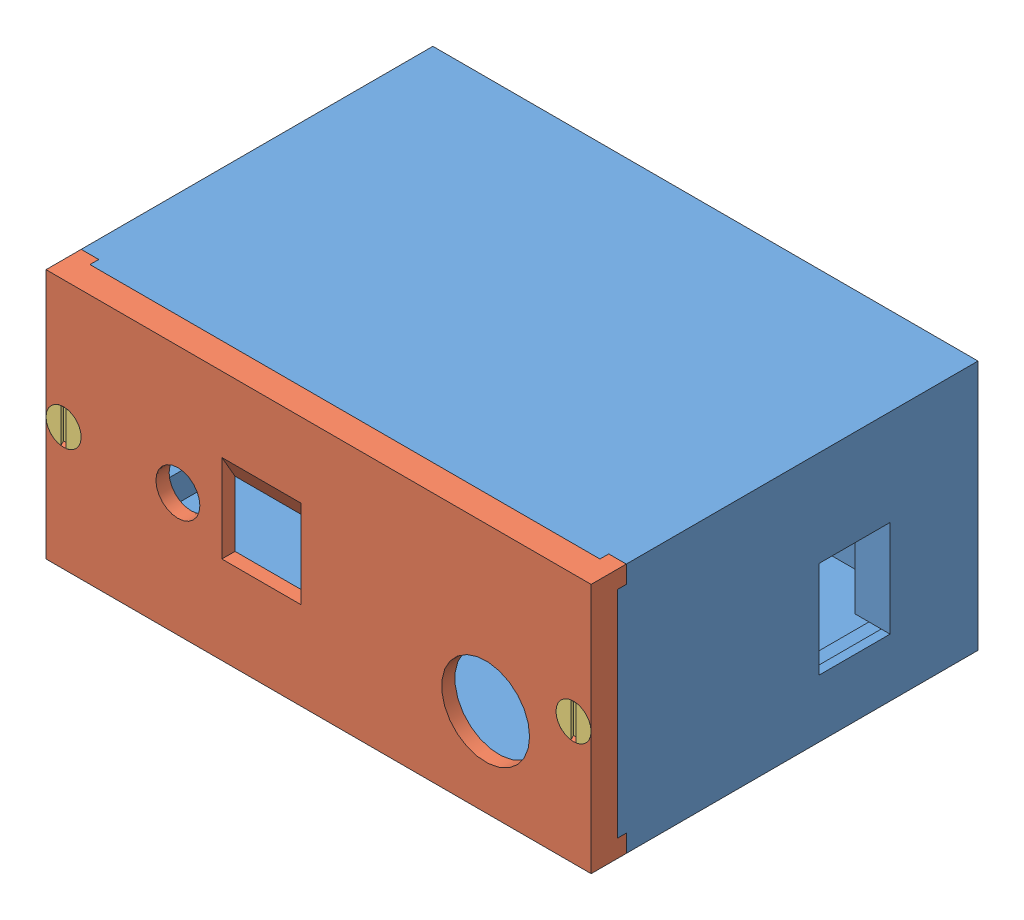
SolidWorks assembly box&lid.SLDASM, configuration Default (file format 3400). Lengths in mm.
Overall size (62 30.5 44).
4 component instances, 3 part files, 8 mates.
Components (placement in the parent):
- Box-1: Box.SLDPRT [Default] at (-0.621 -15.2723 10.7035) size (62 30.5 41)
- lid-1: lid.SLDPRT [Default] at (-0.621 -15.2723 10.7035) size (62 28.5 4)
- bolt2-1: bolt2.SLDPRT [Default] at (-29.621 -1.2723 13.7035) size (4 3.95 11)
- bolt2-2: bolt2.SLDPRT [Default] at (28.379 -1.2723 13.7035) size (4 3.95 11)
Mates (geometry in assembly coordinates):
- Coincident1: coincident anti-aligned: plane of ? through (30.379 11.2277 9.7035) normal (0 0 1); plane of ? through (30.379 11.2277 9.7035) normal (0 0 -1)
- Coincident3: coincident anti-aligned: plane of ? through (30.379 13.2277 10.7035) normal (0 0 1); plane of ? through (30.379 13.2277 10.7035) normal (0 0 -1)
- Coincident4: coincident aligned: plane of ? through (30.379 -15.2723 -30.2965) normal (1 0 0); plane of ? through (30.379 -15.2723 13.7035) normal (1 0 0)
- Coincident5: coincident aligned: plane of ? through (30.379 13.2277 -30.2965) normal (0 1 0); plane of ? through (30.379 13.2277 13.7035) normal (0 1 0)
- Coincident9: coincident aligned: plane of ?; plane of ?
- Concentric2: concentric aligned: cylinder of ?; cylinder of ?
- Coincident10: coincident aligned: plane of ?; plane of ?
- Concentric3: concentric aligned: cylinder of ?; cylinder of ?
